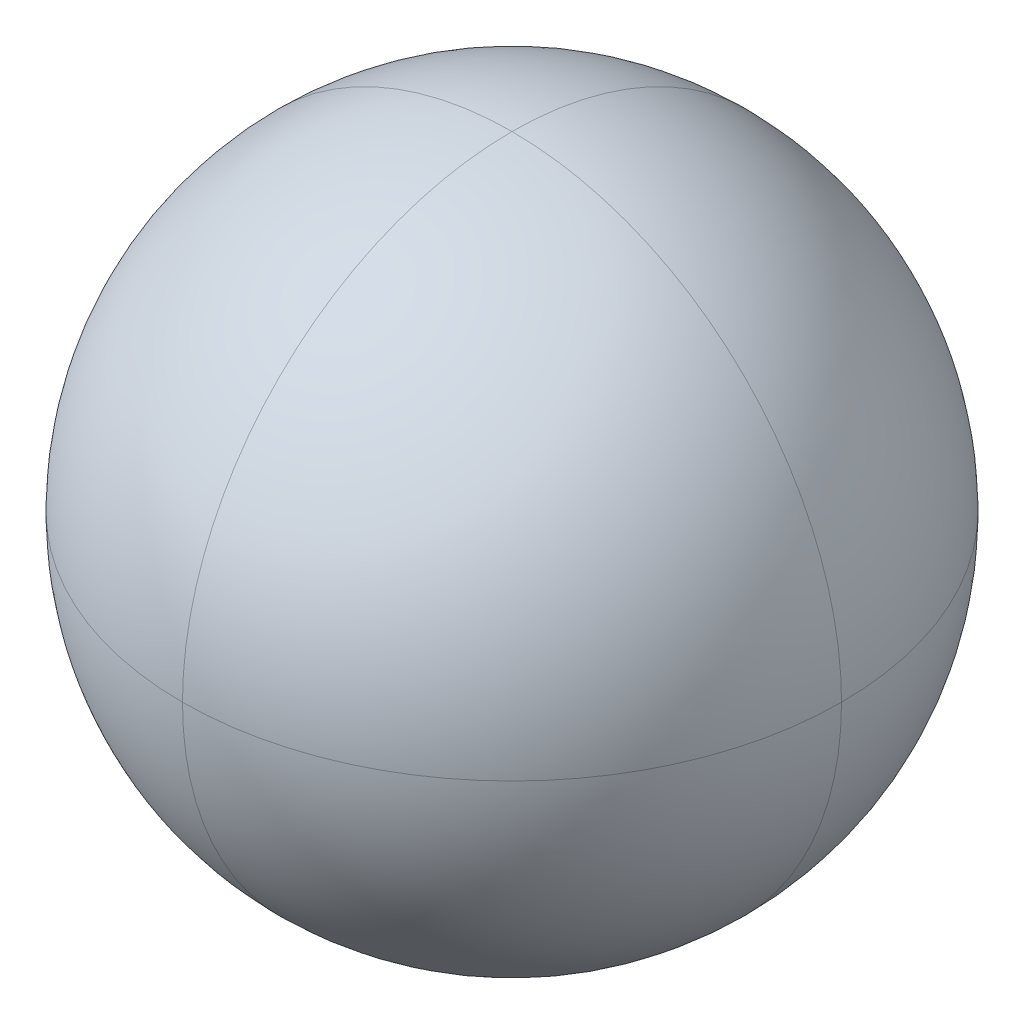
ISO-10303-21;
HEADER;
FILE_DESCRIPTION(('STEP AP214'),'2;1');
FILE_NAME('part.step','',(''),(''),'','','');
FILE_SCHEMA(('AUTOMOTIVE_DESIGN { 1 0 10303 214 1 1 1 1 }'));
ENDSEC;
DATA;
#1=APPLICATION_CONTEXT('core data for automotive mechanical design processes');
#2=APPLICATION_PROTOCOL_DEFINITION('international standard','automotive_design',2000,#1);
#3=PRODUCT_CONTEXT('',#1,'mechanical');
#4=PRODUCT('Part','Part','',(#3));
#5=PRODUCT_RELATED_PRODUCT_CATEGORY('part','',(#4));
#6=PRODUCT_DEFINITION_FORMATION('','',#4);
#7=PRODUCT_DEFINITION_CONTEXT('part definition',#1,'design');
#8=PRODUCT_DEFINITION('design','',#6,#7);
#9=PRODUCT_DEFINITION_SHAPE('','',#8);
#10=(LENGTH_UNIT() NAMED_UNIT(*) SI_UNIT(.MILLI.,.METRE.));
#11=(NAMED_UNIT(*) PLANE_ANGLE_UNIT() SI_UNIT($,.RADIAN.));
#12=(NAMED_UNIT(*) SI_UNIT($,.STERADIAN.) SOLID_ANGLE_UNIT());
#13=UNCERTAINTY_MEASURE_WITH_UNIT(LENGTH_MEASURE(1.E-05),#10,'distance_accuracy_value','');
#14=(GEOMETRIC_REPRESENTATION_CONTEXT(3) GLOBAL_UNCERTAINTY_ASSIGNED_CONTEXT((#13)) GLOBAL_UNIT_ASSIGNED_CONTEXT((#10,
#11,#12)) REPRESENTATION_CONTEXT('',''));
#15=CARTESIAN_POINT('',(0.,0.,0.));
#16=DIRECTION('',(0.,0.,1.));
#17=DIRECTION('',(1.,0.,0.));
#18=AXIS2_PLACEMENT_3D('',#15,#16,#17);
#19=CARTESIAN_POINT('',(0.,0.,0.));
#20=DIRECTION('',(0.,0.,1.));
#21=DIRECTION('',(1.,0.,0.));
#22=AXIS2_PLACEMENT_3D('',#19,#20,#21);
#23=SPHERICAL_SURFACE('',#22,25.);
#24=CARTESIAN_POINT('',(0.,0.,0.));
#25=DIRECTION('',(0.,1.,0.));
#26=DIRECTION('',(-1.,0.,0.));
#27=AXIS2_PLACEMENT_3D('',#24,#25,#26);
#28=CIRCLE('',#27,25.);
#29=CARTESIAN_POINT('',(25.,0.,0.));
#30=VERTEX_POINT('',#29);
#31=CARTESIAN_POINT('',(0.,0.,25.));
#32=VERTEX_POINT('',#31);
#33=EDGE_CURVE('E79',#30,#32,#28,.F.);
#34=ORIENTED_EDGE('',*,*,#33,.F.);
#35=CARTESIAN_POINT('',(0.,0.,0.));
#36=DIRECTION('',(0.,0.,-1.));
#37=DIRECTION('',(-1.,0.,0.));
#38=AXIS2_PLACEMENT_3D('',#35,#36,#37);
#39=CIRCLE('',#38,25.);
#40=CARTESIAN_POINT('',(0.,25.,0.));
#41=VERTEX_POINT('',#40);
#42=EDGE_CURVE('E12',#41,#30,#39,.T.);
#43=ORIENTED_EDGE('',*,*,#42,.F.);
#44=CARTESIAN_POINT('',(0.,0.,0.));
#45=DIRECTION('',(1.,0.,0.));
#46=DIRECTION('',(0.,0.,-1.));
#47=AXIS2_PLACEMENT_3D('',#44,#45,#46);
#48=CIRCLE('',#47,25.);
#49=EDGE_CURVE('E41',#32,#41,#48,.F.);
#50=ORIENTED_EDGE('',*,*,#49,.F.);
#51=EDGE_LOOP('',(#34,#43,#50));
#52=FACE_BOUND('',#51,.T.);
#53=ADVANCED_FACE('F34',(#52),#23,.T.);
#54=CARTESIAN_POINT('',(0.,0.,0.));
#55=DIRECTION('',(0.,0.,1.));
#56=DIRECTION('',(1.,0.,0.));
#57=AXIS2_PLACEMENT_3D('',#54,#55,#56);
#58=SPHERICAL_SURFACE('',#57,25.);
#59=CARTESIAN_POINT('',(0.,0.,0.));
#60=DIRECTION('',(1.,0.,0.));
#61=DIRECTION('',(0.,1.,0.));
#62=AXIS2_PLACEMENT_3D('',#59,#60,#61);
#63=CIRCLE('',#62,25.);
#64=CARTESIAN_POINT('',(0.,0.,-25.));
#65=VERTEX_POINT('',#64);
#66=EDGE_CURVE('E73',#41,#65,#63,.F.);
#67=ORIENTED_EDGE('',*,*,#66,.F.);
#68=ORIENTED_EDGE('',*,*,#42,.T.);
#69=CARTESIAN_POINT('',(0.,0.,0.));
#70=DIRECTION('',(0.,1.,0.));
#71=DIRECTION('',(-1.,0.,0.));
#72=AXIS2_PLACEMENT_3D('',#69,#70,#71);
#73=CIRCLE('',#72,25.);
#74=EDGE_CURVE('E70',#65,#30,#73,.F.);
#75=ORIENTED_EDGE('',*,*,#74,.F.);
#76=EDGE_LOOP('',(#67,#68,#75));
#77=FACE_BOUND('',#76,.T.);
#78=ADVANCED_FACE('F107',(#77),#58,.T.);
#79=CARTESIAN_POINT('',(0.,0.,0.));
#80=DIRECTION('',(0.,0.,1.));
#81=DIRECTION('',(1.,0.,0.));
#82=AXIS2_PLACEMENT_3D('',#79,#80,#81);
#83=SPHERICAL_SURFACE('',#82,25.);
#84=ORIENTED_EDGE('',*,*,#49,.T.);
#85=CARTESIAN_POINT('',(0.,0.,0.));
#86=DIRECTION('',(0.,0.,-1.));
#87=DIRECTION('',(-1.,0.,0.));
#88=AXIS2_PLACEMENT_3D('',#85,#86,#87);
#89=CIRCLE('',#88,25.);
#90=CARTESIAN_POINT('',(-25.,0.,0.));
#91=VERTEX_POINT('',#90);
#92=EDGE_CURVE('E74',#91,#41,#89,.T.);
#93=ORIENTED_EDGE('',*,*,#92,.F.);
#94=CARTESIAN_POINT('',(0.,0.,0.));
#95=DIRECTION('',(0.,1.,0.));
#96=DIRECTION('',(-1.,0.,0.));
#97=AXIS2_PLACEMENT_3D('',#94,#95,#96);
#98=CIRCLE('',#97,25.);
#99=EDGE_CURVE('E84',#32,#91,#98,.F.);
#100=ORIENTED_EDGE('',*,*,#99,.F.);
#101=EDGE_LOOP('',(#84,#93,#100));
#102=FACE_BOUND('',#101,.T.);
#103=ADVANCED_FACE('F105',(#102),#83,.T.);
#104=CARTESIAN_POINT('',(0.,0.,0.));
#105=DIRECTION('',(0.,0.,1.));
#106=DIRECTION('',(1.,0.,0.));
#107=AXIS2_PLACEMENT_3D('',#104,#105,#106);
#108=SPHERICAL_SURFACE('',#107,25.);
#109=CARTESIAN_POINT('',(0.,0.,0.));
#110=DIRECTION('',(0.,0.,1.));
#111=DIRECTION('',(1.,0.,0.));
#112=AXIS2_PLACEMENT_3D('',#109,#110,#111);
#113=CIRCLE('',#112,25.);
#114=CARTESIAN_POINT('',(0.,-25.,0.));
#115=VERTEX_POINT('',#114);
#116=EDGE_CURVE('E64',#115,#30,#113,.T.);
#117=ORIENTED_EDGE('',*,*,#116,.T.);
#118=ORIENTED_EDGE('',*,*,#33,.T.);
#119=CARTESIAN_POINT('',(0.,0.,0.));
#120=DIRECTION('',(1.,0.,0.));
#121=DIRECTION('',(0.,1.,0.));
#122=AXIS2_PLACEMENT_3D('',#119,#120,#121);
#123=CIRCLE('',#122,25.);
#124=EDGE_CURVE('E77',#115,#32,#123,.F.);
#125=ORIENTED_EDGE('',*,*,#124,.F.);
#126=EDGE_LOOP('',(#117,#118,#125));
#127=FACE_BOUND('',#126,.T.);
#128=ADVANCED_FACE('F78',(#127),#108,.T.);
#129=CARTESIAN_POINT('',(0.,0.,0.));
#130=DIRECTION('',(0.,0.,1.));
#131=DIRECTION('',(1.,0.,0.));
#132=AXIS2_PLACEMENT_3D('',#129,#130,#131);
#133=SPHERICAL_SURFACE('',#132,25.);
#134=ORIENTED_EDGE('',*,*,#74,.T.);
#135=ORIENTED_EDGE('',*,*,#116,.F.);
#136=CARTESIAN_POINT('',(0.,0.,0.));
#137=DIRECTION('',(1.,0.,0.));
#138=DIRECTION('',(0.,1.,0.));
#139=AXIS2_PLACEMENT_3D('',#136,#137,#138);
#140=CIRCLE('',#139,25.);
#141=EDGE_CURVE('E68',#65,#115,#140,.F.);
#142=ORIENTED_EDGE('',*,*,#141,.F.);
#143=EDGE_LOOP('',(#134,#135,#142));
#144=FACE_BOUND('',#143,.T.);
#145=ADVANCED_FACE('F66',(#144),#133,.T.);
#146=CARTESIAN_POINT('',(0.,0.,0.));
#147=DIRECTION('',(0.,0.,1.));
#148=DIRECTION('',(1.,0.,0.));
#149=AXIS2_PLACEMENT_3D('',#146,#147,#148);
#150=SPHERICAL_SURFACE('',#149,25.);
#151=ORIENTED_EDGE('',*,*,#92,.T.);
#152=ORIENTED_EDGE('',*,*,#66,.T.);
#153=CARTESIAN_POINT('',(0.,0.,0.));
#154=DIRECTION('',(0.,1.,0.));
#155=DIRECTION('',(-1.,0.,0.));
#156=AXIS2_PLACEMENT_3D('',#153,#154,#155);
#157=CIRCLE('',#156,25.);
#158=EDGE_CURVE('E91',#91,#65,#157,.F.);
#159=ORIENTED_EDGE('',*,*,#158,.F.);
#160=EDGE_LOOP('',(#151,#152,#159));
#161=FACE_BOUND('',#160,.T.);
#162=ADVANCED_FACE('F120',(#161),#150,.T.);
#163=CARTESIAN_POINT('',(0.,0.,0.));
#164=DIRECTION('',(0.,0.,1.));
#165=DIRECTION('',(1.,0.,0.));
#166=AXIS2_PLACEMENT_3D('',#163,#164,#165);
#167=SPHERICAL_SURFACE('',#166,25.);
#168=ORIENTED_EDGE('',*,*,#124,.T.);
#169=ORIENTED_EDGE('',*,*,#99,.T.);
#170=CARTESIAN_POINT('',(0.,0.,0.));
#171=DIRECTION('',(0.,0.,1.));
#172=DIRECTION('',(1.,0.,0.));
#173=AXIS2_PLACEMENT_3D('',#170,#171,#172);
#174=CIRCLE('',#173,25.);
#175=EDGE_CURVE('E89',#115,#91,#174,.F.);
#176=ORIENTED_EDGE('',*,*,#175,.F.);
#177=EDGE_LOOP('',(#168,#169,#176));
#178=FACE_BOUND('',#177,.T.);
#179=ADVANCED_FACE('F93',(#178),#167,.T.);
#180=CARTESIAN_POINT('',(0.,0.,0.));
#181=DIRECTION('',(0.,0.,1.));
#182=DIRECTION('',(1.,0.,0.));
#183=AXIS2_PLACEMENT_3D('',#180,#181,#182);
#184=SPHERICAL_SURFACE('',#183,25.);
#185=ORIENTED_EDGE('',*,*,#158,.T.);
#186=ORIENTED_EDGE('',*,*,#141,.T.);
#187=ORIENTED_EDGE('',*,*,#175,.T.);
#188=EDGE_LOOP('',(#185,#186,#187));
#189=FACE_BOUND('',#188,.T.);
#190=ADVANCED_FACE('F88',(#189),#184,.T.);
#191=CLOSED_SHELL('',(#53,#78,#103,#128,#145,#162,#179,#190));
#192=MANIFOLD_SOLID_BREP('B2',#191);
#193=ADVANCED_BREP_SHAPE_REPRESENTATION('',(#18,#192),#14);
#194=SHAPE_DEFINITION_REPRESENTATION(#9,#193);
ENDSEC;
END-ISO-10303-21;
